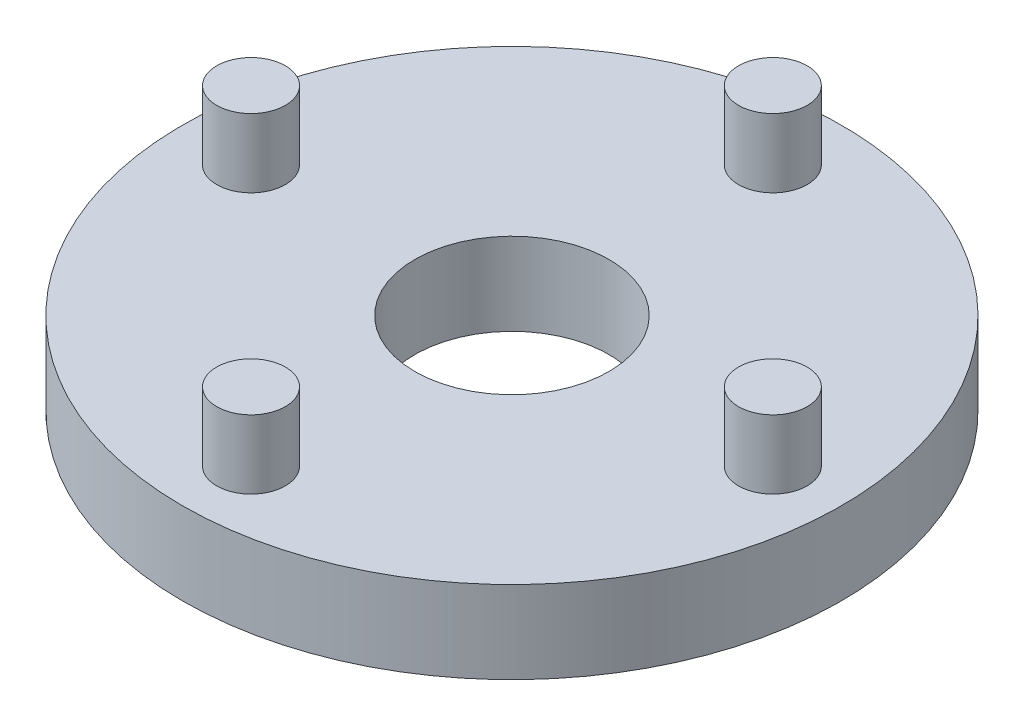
from build123d import *

# Parameters (mm, degrees)
SKETCH1_R           = 24
BOSS_EXTRUDE1_DEPTH = 6
SKETCH3_R           = 7.071067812
CUT_EXTRUDE2_DEPTH  = 6
SKETCH12_R          = 2.5
BOSS_EXTRUDE2_DEPTH = 5
SKETCH13_R          = 21
SKETCH13_R_2        = 10.5
CUT_EXTRUDE3_DEPTH  = 4


with BuildPart() as part:
    # Sketch1 → Boss-Extrude1 (new body)
    with BuildSketch(Plane(origin=(0, 0, 0), x_dir=(1, 0, 0), z_dir=(0, 1, 0))):
        with Locations(Location((0, 0, 0), (0, 0, 270))):
            Circle(SKETCH1_R)
    extrude(amount=BOSS_EXTRUDE1_DEPTH)

    # Sketch3 → Cut-Extrude2 (cut)
    with BuildSketch(Plane(origin=(0, 6, 0), x_dir=(1, 0, 0), z_dir=(0, 1, 0))):
        with Locations(Location((0, 0, 0), (0, 0, 270))):
            Circle(SKETCH3_R)
    extrude(amount=-CUT_EXTRUDE2_DEPTH, mode=Mode.SUBTRACT)

    # Sketch12 → Boss-Extrude2 (add)
    with BuildSketch(Plane(origin=(0, 6, 0), x_dir=(1, 0, 0), z_dir=(0, 1, 0))):
        with Locations(Location((-19, 0, 0), (0, 0, 270))):
            Circle(SKETCH12_R)
        with Locations(Location((0, 19, 0), (0, 0, 270))):
            Circle(SKETCH12_R)
        with Locations(Location((19, 0, 0), (0, 0, 270))):
            Circle(SKETCH12_R)
        with Locations(Location((0, -19, 0), (0, 0, 270))):
            Circle(SKETCH12_R)
    extrude(amount=BOSS_EXTRUDE2_DEPTH)

    # Sketch13 → Cut-Extrude3 (cut)
    with BuildSketch(Plane.XZ):
        with Locations(Location((0, 0, 0), (0, 0, 270))):
            Circle(SKETCH13_R)
        with Locations(Location((0, 0, 0), (0, 0, 270))):
            Circle(SKETCH13_R_2, mode=Mode.SUBTRACT)
    extrude(amount=-CUT_EXTRUDE3_DEPTH, mode=Mode.SUBTRACT)


solid = part.part
